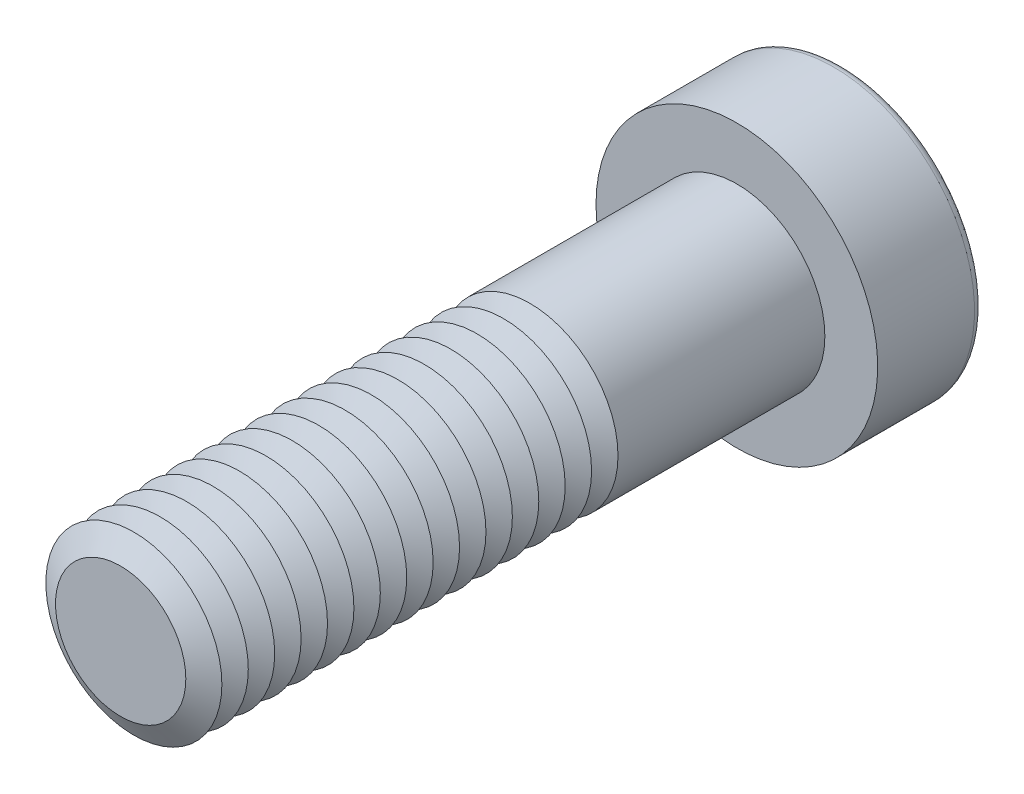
ISO-10303-21;
HEADER;
FILE_DESCRIPTION(('STEP AP214'),'2;1');
FILE_NAME('part.step','',(''),(''),'','','');
FILE_SCHEMA(('AUTOMOTIVE_DESIGN { 1 0 10303 214 1 1 1 1 }'));
ENDSEC;
DATA;
#1=APPLICATION_CONTEXT('core data for automotive mechanical design processes');
#2=APPLICATION_PROTOCOL_DEFINITION('international standard','automotive_design',2000,#1);
#3=PRODUCT_CONTEXT('',#1,'mechanical');
#4=PRODUCT('Part','Part','',(#3));
#5=PRODUCT_RELATED_PRODUCT_CATEGORY('part','',(#4));
#6=PRODUCT_DEFINITION_FORMATION('','',#4);
#7=PRODUCT_DEFINITION_CONTEXT('part definition',#1,'design');
#8=PRODUCT_DEFINITION('design','',#6,#7);
#9=PRODUCT_DEFINITION_SHAPE('','',#8);
#10=(LENGTH_UNIT() NAMED_UNIT(*) SI_UNIT(.MILLI.,.METRE.));
#11=(NAMED_UNIT(*) PLANE_ANGLE_UNIT() SI_UNIT($,.RADIAN.));
#12=(NAMED_UNIT(*) SI_UNIT($,.STERADIAN.) SOLID_ANGLE_UNIT());
#13=UNCERTAINTY_MEASURE_WITH_UNIT(LENGTH_MEASURE(1.E-05),#10,'distance_accuracy_value','');
#14=(GEOMETRIC_REPRESENTATION_CONTEXT(3) GLOBAL_UNCERTAINTY_ASSIGNED_CONTEXT((#13)) GLOBAL_UNIT_ASSIGNED_CONTEXT((#10,
#11,#12)) REPRESENTATION_CONTEXT('',''));
#15=CARTESIAN_POINT('',(0.,0.,0.));
#16=DIRECTION('',(0.,0.,1.));
#17=DIRECTION('',(1.,0.,0.));
#18=AXIS2_PLACEMENT_3D('',#15,#16,#17);
#19=CARTESIAN_POINT('',(0.,0.,29.75));
#20=DIRECTION('',(0.,0.,1.));
#21=DIRECTION('',(1.,0.,0.));
#22=AXIS2_PLACEMENT_3D('',#19,#20,#21);
#23=CONICAL_SURFACE('',#22,5.,1.0471975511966);
#24=CARTESIAN_POINT('',(0.,0.,29.));
#25=DIRECTION('',(0.,0.,1.));
#26=DIRECTION('',(1.,0.,0.));
#27=AXIS2_PLACEMENT_3D('',#24,#25,#26);
#28=CIRCLE('',#27,3.70096189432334);
#29=CARTESIAN_POINT('',(3.70096189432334,0.,29.));
#30=VERTEX_POINT('',#29);
#31=EDGE_CURVE('E313',#30,#30,#28,.T.);
#32=ORIENTED_EDGE('',*,*,#31,.T.);
#33=EDGE_LOOP('',(#32));
#34=FACE_BOUND('',#33,.T.);
#35=CARTESIAN_POINT('',(0.,0.,29.75));
#36=DIRECTION('',(0.,0.,1.));
#37=DIRECTION('',(1.,0.,0.));
#38=AXIS2_PLACEMENT_3D('',#35,#36,#37);
#39=CIRCLE('',#38,5.);
#40=CARTESIAN_POINT('',(5.,0.,29.75));
#41=VERTEX_POINT('',#40);
#42=EDGE_CURVE('E316',#41,#41,#39,.T.);
#43=ORIENTED_EDGE('',*,*,#42,.F.);
#44=EDGE_LOOP('',(#43));
#45=FACE_BOUND('',#44,.T.);
#46=ADVANCED_FACE('F39',(#34,#45),#23,.T.);
#47=CARTESIAN_POINT('',(0.,0.,29.));
#48=DIRECTION('',(0.,0.,-1.));
#49=DIRECTION('',(-1.,0.,0.));
#50=AXIS2_PLACEMENT_3D('',#47,#48,#49);
#51=CONICAL_SURFACE('',#50,3.70096189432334,1.0471975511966);
#52=CARTESIAN_POINT('',(0.,0.,28.25));
#53=DIRECTION('',(0.,0.,1.));
#54=DIRECTION('',(1.,0.,0.));
#55=AXIS2_PLACEMENT_3D('',#52,#53,#54);
#56=CIRCLE('',#55,5.);
#57=CARTESIAN_POINT('',(5.,0.,28.25));
#58=VERTEX_POINT('',#57);
#59=EDGE_CURVE('E324',#58,#58,#56,.T.);
#60=ORIENTED_EDGE('',*,*,#59,.T.);
#61=EDGE_LOOP('',(#60));
#62=FACE_BOUND('',#61,.T.);
#63=ORIENTED_EDGE('',*,*,#31,.F.);
#64=EDGE_LOOP('',(#63));
#65=FACE_BOUND('',#64,.T.);
#66=ADVANCED_FACE('F245',(#62,#65),#51,.T.);
#67=CARTESIAN_POINT('',(0.,0.,35.));
#68=DIRECTION('',(0.,0.,1.));
#69=DIRECTION('',(1.,0.,0.));
#70=AXIS2_PLACEMENT_3D('',#67,#68,#69);
#71=PLANE('',#70);
#72=CARTESIAN_POINT('',(0.,0.,35.));
#73=DIRECTION('',(0.,0.,1.));
#74=DIRECTION('',(1.,0.,0.));
#75=AXIS2_PLACEMENT_3D('',#72,#73,#74);
#76=CIRCLE('',#75,3.70096189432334);
#77=CARTESIAN_POINT('',(3.70096189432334,0.,35.));
#78=VERTEX_POINT('',#77);
#79=EDGE_CURVE('E174',#78,#78,#76,.T.);
#80=ORIENTED_EDGE('',*,*,#79,.T.);
#81=EDGE_LOOP('',(#80));
#82=FACE_BOUND('',#81,.T.);
#83=ADVANCED_FACE('F251',(#82),#71,.T.);
#84=CARTESIAN_POINT('',(0.,0.,35.));
#85=DIRECTION('',(0.,0.,-1.));
#86=DIRECTION('',(-1.,0.,0.));
#87=AXIS2_PLACEMENT_3D('',#84,#85,#86);
#88=CONICAL_SURFACE('',#87,3.70096189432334,1.0471975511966);
#89=CARTESIAN_POINT('',(0.,0.,34.25));
#90=DIRECTION('',(0.,0.,1.));
#91=DIRECTION('',(1.,0.,0.));
#92=AXIS2_PLACEMENT_3D('',#89,#90,#91);
#93=CIRCLE('',#92,5.);
#94=CARTESIAN_POINT('',(5.,0.,34.25));
#95=VERTEX_POINT('',#94);
#96=EDGE_CURVE('E291',#95,#95,#93,.T.);
#97=ORIENTED_EDGE('',*,*,#96,.T.);
#98=EDGE_LOOP('',(#97));
#99=FACE_BOUND('',#98,.T.);
#100=ORIENTED_EDGE('',*,*,#79,.F.);
#101=EDGE_LOOP('',(#100));
#102=FACE_BOUND('',#101,.T.);
#103=ADVANCED_FACE('F199',(#99,#102),#88,.T.);
#104=CARTESIAN_POINT('',(0.,0.,34.25));
#105=DIRECTION('',(0.,0.,1.));
#106=DIRECTION('',(1.,0.,0.));
#107=AXIS2_PLACEMENT_3D('',#104,#105,#106);
#108=CONICAL_SURFACE('',#107,5.,1.0471975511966);
#109=CARTESIAN_POINT('',(0.,0.,33.5));
#110=DIRECTION('',(0.,0.,1.));
#111=DIRECTION('',(1.,0.,0.));
#112=AXIS2_PLACEMENT_3D('',#109,#110,#111);
#113=CIRCLE('',#112,3.70096189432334);
#114=CARTESIAN_POINT('',(3.70096189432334,0.,33.5));
#115=VERTEX_POINT('',#114);
#116=EDGE_CURVE('E288',#115,#115,#113,.T.);
#117=ORIENTED_EDGE('',*,*,#116,.T.);
#118=EDGE_LOOP('',(#117));
#119=FACE_BOUND('',#118,.T.);
#120=ORIENTED_EDGE('',*,*,#96,.F.);
#121=EDGE_LOOP('',(#120));
#122=FACE_BOUND('',#121,.T.);
#123=ADVANCED_FACE('F277',(#119,#122),#108,.T.);
#124=CARTESIAN_POINT('',(0.,0.,33.5));
#125=DIRECTION('',(0.,0.,-1.));
#126=DIRECTION('',(-1.,0.,0.));
#127=AXIS2_PLACEMENT_3D('',#124,#125,#126);
#128=CONICAL_SURFACE('',#127,3.70096189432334,1.0471975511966);
#129=CARTESIAN_POINT('',(0.,0.,32.75));
#130=DIRECTION('',(0.,0.,1.));
#131=DIRECTION('',(1.,0.,0.));
#132=AXIS2_PLACEMENT_3D('',#129,#130,#131);
#133=CIRCLE('',#132,5.);
#134=CARTESIAN_POINT('',(5.,0.,32.75));
#135=VERTEX_POINT('',#134);
#136=EDGE_CURVE('E299',#135,#135,#133,.T.);
#137=ORIENTED_EDGE('',*,*,#136,.T.);
#138=EDGE_LOOP('',(#137));
#139=FACE_BOUND('',#138,.T.);
#140=ORIENTED_EDGE('',*,*,#116,.F.);
#141=EDGE_LOOP('',(#140));
#142=FACE_BOUND('',#141,.T.);
#143=ADVANCED_FACE('F274',(#139,#142),#128,.T.);
#144=CARTESIAN_POINT('',(0.,0.,32.75));
#145=DIRECTION('',(0.,0.,1.));
#146=DIRECTION('',(1.,0.,0.));
#147=AXIS2_PLACEMENT_3D('',#144,#145,#146);
#148=CONICAL_SURFACE('',#147,5.,1.0471975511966);
#149=CARTESIAN_POINT('',(0.,0.,32.));
#150=DIRECTION('',(0.,0.,1.));
#151=DIRECTION('',(1.,0.,0.));
#152=AXIS2_PLACEMENT_3D('',#149,#150,#151);
#153=CIRCLE('',#152,3.70096189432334);
#154=CARTESIAN_POINT('',(3.70096189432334,0.,32.));
#155=VERTEX_POINT('',#154);
#156=EDGE_CURVE('E293',#155,#155,#153,.T.);
#157=ORIENTED_EDGE('',*,*,#156,.T.);
#158=EDGE_LOOP('',(#157));
#159=FACE_BOUND('',#158,.T.);
#160=ORIENTED_EDGE('',*,*,#136,.F.);
#161=EDGE_LOOP('',(#160));
#162=FACE_BOUND('',#161,.T.);
#163=ADVANCED_FACE('F270',(#159,#162),#148,.T.);
#164=CARTESIAN_POINT('',(0.,0.,32.));
#165=DIRECTION('',(0.,0.,-1.));
#166=DIRECTION('',(-1.,0.,0.));
#167=AXIS2_PLACEMENT_3D('',#164,#165,#166);
#168=CONICAL_SURFACE('',#167,3.70096189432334,1.0471975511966);
#169=CARTESIAN_POINT('',(0.,0.,31.25));
#170=DIRECTION('',(0.,0.,1.));
#171=DIRECTION('',(1.,0.,0.));
#172=AXIS2_PLACEMENT_3D('',#169,#170,#171);
#173=CIRCLE('',#172,5.);
#174=CARTESIAN_POINT('',(5.,0.,31.25));
#175=VERTEX_POINT('',#174);
#176=EDGE_CURVE('E309',#175,#175,#173,.T.);
#177=ORIENTED_EDGE('',*,*,#176,.T.);
#178=EDGE_LOOP('',(#177));
#179=FACE_BOUND('',#178,.T.);
#180=ORIENTED_EDGE('',*,*,#156,.F.);
#181=EDGE_LOOP('',(#180));
#182=FACE_BOUND('',#181,.T.);
#183=ADVANCED_FACE('F266',(#179,#182),#168,.T.);
#184=CARTESIAN_POINT('',(0.,0.,31.25));
#185=DIRECTION('',(0.,0.,1.));
#186=DIRECTION('',(1.,0.,0.));
#187=AXIS2_PLACEMENT_3D('',#184,#185,#186);
#188=CONICAL_SURFACE('',#187,5.,1.0471975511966);
#189=CARTESIAN_POINT('',(0.,0.,30.5));
#190=DIRECTION('',(0.,0.,1.));
#191=DIRECTION('',(1.,0.,0.));
#192=AXIS2_PLACEMENT_3D('',#189,#190,#191);
#193=CIRCLE('',#192,3.70096189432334);
#194=CARTESIAN_POINT('',(3.70096189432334,0.,30.5));
#195=VERTEX_POINT('',#194);
#196=EDGE_CURVE('E305',#195,#195,#193,.T.);
#197=ORIENTED_EDGE('',*,*,#196,.T.);
#198=EDGE_LOOP('',(#197));
#199=FACE_BOUND('',#198,.T.);
#200=ORIENTED_EDGE('',*,*,#176,.F.);
#201=EDGE_LOOP('',(#200));
#202=FACE_BOUND('',#201,.T.);
#203=ADVANCED_FACE('F262',(#199,#202),#188,.T.);
#204=CARTESIAN_POINT('',(0.,0.,30.5));
#205=DIRECTION('',(0.,0.,-1.));
#206=DIRECTION('',(-1.,0.,0.));
#207=AXIS2_PLACEMENT_3D('',#204,#205,#206);
#208=CONICAL_SURFACE('',#207,3.70096189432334,1.0471975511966);
#209=ORIENTED_EDGE('',*,*,#42,.T.);
#210=EDGE_LOOP('',(#209));
#211=FACE_BOUND('',#210,.T.);
#212=ORIENTED_EDGE('',*,*,#196,.F.);
#213=EDGE_LOOP('',(#212));
#214=FACE_BOUND('',#213,.T.);
#215=ADVANCED_FACE('F258',(#211,#214),#208,.T.);
#216=CARTESIAN_POINT('',(0.,0.,28.25));
#217=DIRECTION('',(0.,0.,1.));
#218=DIRECTION('',(1.,0.,0.));
#219=AXIS2_PLACEMENT_3D('',#216,#217,#218);
#220=CONICAL_SURFACE('',#219,5.,1.0471975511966);
#221=CARTESIAN_POINT('',(0.,0.,27.5));
#222=DIRECTION('',(0.,0.,1.));
#223=DIRECTION('',(1.,0.,0.));
#224=AXIS2_PLACEMENT_3D('',#221,#222,#223);
#225=CIRCLE('',#224,3.70096189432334);
#226=CARTESIAN_POINT('',(3.70096189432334,0.,27.5));
#227=VERTEX_POINT('',#226);
#228=EDGE_CURVE('E320',#227,#227,#225,.T.);
#229=ORIENTED_EDGE('',*,*,#228,.T.);
#230=EDGE_LOOP('',(#229));
#231=FACE_BOUND('',#230,.T.);
#232=ORIENTED_EDGE('',*,*,#59,.F.);
#233=EDGE_LOOP('',(#232));
#234=FACE_BOUND('',#233,.T.);
#235=ADVANCED_FACE('F261',(#231,#234),#220,.T.);
#236=CARTESIAN_POINT('',(0.,0.,27.5));
#237=DIRECTION('',(0.,0.,-1.));
#238=DIRECTION('',(-1.,0.,0.));
#239=AXIS2_PLACEMENT_3D('',#236,#237,#238);
#240=CONICAL_SURFACE('',#239,3.70096189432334,1.0471975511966);
#241=CARTESIAN_POINT('',(0.,0.,26.75));
#242=DIRECTION('',(0.,0.,1.));
#243=DIRECTION('',(1.,0.,0.));
#244=AXIS2_PLACEMENT_3D('',#241,#242,#243);
#245=CIRCLE('',#244,5.);
#246=CARTESIAN_POINT('',(5.,0.,26.75));
#247=VERTEX_POINT('',#246);
#248=EDGE_CURVE('E332',#247,#247,#245,.T.);
#249=ORIENTED_EDGE('',*,*,#248,.T.);
#250=EDGE_LOOP('',(#249));
#251=FACE_BOUND('',#250,.T.);
#252=ORIENTED_EDGE('',*,*,#228,.F.);
#253=EDGE_LOOP('',(#252));
#254=FACE_BOUND('',#253,.T.);
#255=ADVANCED_FACE('F495',(#251,#254),#240,.T.);
#256=CARTESIAN_POINT('',(0.,0.,26.75));
#257=DIRECTION('',(0.,0.,1.));
#258=DIRECTION('',(1.,0.,0.));
#259=AXIS2_PLACEMENT_3D('',#256,#257,#258);
#260=CONICAL_SURFACE('',#259,5.,1.0471975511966);
#261=CARTESIAN_POINT('',(0.,0.,26.));
#262=DIRECTION('',(0.,0.,1.));
#263=DIRECTION('',(1.,0.,0.));
#264=AXIS2_PLACEMENT_3D('',#261,#262,#263);
#265=CIRCLE('',#264,3.70096189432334);
#266=CARTESIAN_POINT('',(3.70096189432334,0.,26.));
#267=VERTEX_POINT('',#266);
#268=EDGE_CURVE('E328',#267,#267,#265,.T.);
#269=ORIENTED_EDGE('',*,*,#268,.T.);
#270=EDGE_LOOP('',(#269));
#271=FACE_BOUND('',#270,.T.);
#272=ORIENTED_EDGE('',*,*,#248,.F.);
#273=EDGE_LOOP('',(#272));
#274=FACE_BOUND('',#273,.T.);
#275=ADVANCED_FACE('F491',(#271,#274),#260,.T.);
#276=CARTESIAN_POINT('',(0.,0.,26.));
#277=DIRECTION('',(0.,0.,-1.));
#278=DIRECTION('',(-1.,0.,0.));
#279=AXIS2_PLACEMENT_3D('',#276,#277,#278);
#280=CONICAL_SURFACE('',#279,3.70096189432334,1.0471975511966);
#281=CARTESIAN_POINT('',(0.,0.,25.25));
#282=DIRECTION('',(0.,0.,1.));
#283=DIRECTION('',(1.,0.,0.));
#284=AXIS2_PLACEMENT_3D('',#281,#282,#283);
#285=CIRCLE('',#284,5.);
#286=CARTESIAN_POINT('',(5.,0.,25.25));
#287=VERTEX_POINT('',#286);
#288=EDGE_CURVE('E340',#287,#287,#285,.T.);
#289=ORIENTED_EDGE('',*,*,#288,.T.);
#290=EDGE_LOOP('',(#289));
#291=FACE_BOUND('',#290,.T.);
#292=ORIENTED_EDGE('',*,*,#268,.F.);
#293=EDGE_LOOP('',(#292));
#294=FACE_BOUND('',#293,.T.);
#295=ADVANCED_FACE('F487',(#291,#294),#280,.T.);
#296=CARTESIAN_POINT('',(0.,0.,25.25));
#297=DIRECTION('',(0.,0.,1.));
#298=DIRECTION('',(1.,0.,0.));
#299=AXIS2_PLACEMENT_3D('',#296,#297,#298);
#300=CONICAL_SURFACE('',#299,5.,1.0471975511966);
#301=CARTESIAN_POINT('',(0.,0.,24.5));
#302=DIRECTION('',(0.,0.,1.));
#303=DIRECTION('',(1.,0.,0.));
#304=AXIS2_PLACEMENT_3D('',#301,#302,#303);
#305=CIRCLE('',#304,3.70096189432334);
#306=CARTESIAN_POINT('',(3.70096189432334,0.,24.5));
#307=VERTEX_POINT('',#306);
#308=EDGE_CURVE('E336',#307,#307,#305,.T.);
#309=ORIENTED_EDGE('',*,*,#308,.T.);
#310=EDGE_LOOP('',(#309));
#311=FACE_BOUND('',#310,.T.);
#312=ORIENTED_EDGE('',*,*,#288,.F.);
#313=EDGE_LOOP('',(#312));
#314=FACE_BOUND('',#313,.T.);
#315=ADVANCED_FACE('F483',(#311,#314),#300,.T.);
#316=CARTESIAN_POINT('',(0.,0.,24.5));
#317=DIRECTION('',(0.,0.,-1.));
#318=DIRECTION('',(-1.,0.,0.));
#319=AXIS2_PLACEMENT_3D('',#316,#317,#318);
#320=CONICAL_SURFACE('',#319,3.70096189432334,1.0471975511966);
#321=CARTESIAN_POINT('',(0.,0.,23.75));
#322=DIRECTION('',(0.,0.,1.));
#323=DIRECTION('',(1.,0.,0.));
#324=AXIS2_PLACEMENT_3D('',#321,#322,#323);
#325=CIRCLE('',#324,5.);
#326=CARTESIAN_POINT('',(5.,0.,23.75));
#327=VERTEX_POINT('',#326);
#328=EDGE_CURVE('E348',#327,#327,#325,.T.);
#329=ORIENTED_EDGE('',*,*,#328,.T.);
#330=EDGE_LOOP('',(#329));
#331=FACE_BOUND('',#330,.T.);
#332=ORIENTED_EDGE('',*,*,#308,.F.);
#333=EDGE_LOOP('',(#332));
#334=FACE_BOUND('',#333,.T.);
#335=ADVANCED_FACE('F479',(#331,#334),#320,.T.);
#336=CARTESIAN_POINT('',(0.,0.,23.75));
#337=DIRECTION('',(0.,0.,1.));
#338=DIRECTION('',(1.,0.,0.));
#339=AXIS2_PLACEMENT_3D('',#336,#337,#338);
#340=CONICAL_SURFACE('',#339,5.,1.0471975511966);
#341=CARTESIAN_POINT('',(0.,0.,23.));
#342=DIRECTION('',(0.,0.,1.));
#343=DIRECTION('',(1.,0.,0.));
#344=AXIS2_PLACEMENT_3D('',#341,#342,#343);
#345=CIRCLE('',#344,3.70096189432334);
#346=CARTESIAN_POINT('',(3.70096189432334,0.,23.));
#347=VERTEX_POINT('',#346);
#348=EDGE_CURVE('E344',#347,#347,#345,.T.);
#349=ORIENTED_EDGE('',*,*,#348,.T.);
#350=EDGE_LOOP('',(#349));
#351=FACE_BOUND('',#350,.T.);
#352=ORIENTED_EDGE('',*,*,#328,.F.);
#353=EDGE_LOOP('',(#352));
#354=FACE_BOUND('',#353,.T.);
#355=ADVANCED_FACE('F475',(#351,#354),#340,.T.);
#356=CARTESIAN_POINT('',(0.,0.,23.));
#357=DIRECTION('',(0.,0.,-1.));
#358=DIRECTION('',(-1.,0.,0.));
#359=AXIS2_PLACEMENT_3D('',#356,#357,#358);
#360=CONICAL_SURFACE('',#359,3.70096189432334,1.0471975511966);
#361=CARTESIAN_POINT('',(0.,0.,22.25));
#362=DIRECTION('',(0.,0.,1.));
#363=DIRECTION('',(1.,0.,0.));
#364=AXIS2_PLACEMENT_3D('',#361,#362,#363);
#365=CIRCLE('',#364,5.);
#366=CARTESIAN_POINT('',(5.,0.,22.25));
#367=VERTEX_POINT('',#366);
#368=EDGE_CURVE('E356',#367,#367,#365,.T.);
#369=ORIENTED_EDGE('',*,*,#368,.T.);
#370=EDGE_LOOP('',(#369));
#371=FACE_BOUND('',#370,.T.);
#372=ORIENTED_EDGE('',*,*,#348,.F.);
#373=EDGE_LOOP('',(#372));
#374=FACE_BOUND('',#373,.T.);
#375=ADVANCED_FACE('F471',(#371,#374),#360,.T.);
#376=CARTESIAN_POINT('',(0.,0.,22.25));
#377=DIRECTION('',(0.,0.,1.));
#378=DIRECTION('',(1.,0.,0.));
#379=AXIS2_PLACEMENT_3D('',#376,#377,#378);
#380=CONICAL_SURFACE('',#379,5.,1.0471975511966);
#381=CARTESIAN_POINT('',(0.,0.,21.5));
#382=DIRECTION('',(0.,0.,1.));
#383=DIRECTION('',(1.,0.,0.));
#384=AXIS2_PLACEMENT_3D('',#381,#382,#383);
#385=CIRCLE('',#384,3.70096189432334);
#386=CARTESIAN_POINT('',(3.70096189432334,0.,21.5));
#387=VERTEX_POINT('',#386);
#388=EDGE_CURVE('E352',#387,#387,#385,.T.);
#389=ORIENTED_EDGE('',*,*,#388,.T.);
#390=EDGE_LOOP('',(#389));
#391=FACE_BOUND('',#390,.T.);
#392=ORIENTED_EDGE('',*,*,#368,.F.);
#393=EDGE_LOOP('',(#392));
#394=FACE_BOUND('',#393,.T.);
#395=ADVANCED_FACE('F467',(#391,#394),#380,.T.);
#396=CARTESIAN_POINT('',(0.,0.,21.5));
#397=DIRECTION('',(0.,0.,-1.));
#398=DIRECTION('',(-1.,0.,0.));
#399=AXIS2_PLACEMENT_3D('',#396,#397,#398);
#400=CONICAL_SURFACE('',#399,3.70096189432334,1.0471975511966);
#401=CARTESIAN_POINT('',(0.,0.,20.75));
#402=DIRECTION('',(0.,0.,1.));
#403=DIRECTION('',(1.,0.,0.));
#404=AXIS2_PLACEMENT_3D('',#401,#402,#403);
#405=CIRCLE('',#404,5.);
#406=CARTESIAN_POINT('',(5.,0.,20.75));
#407=VERTEX_POINT('',#406);
#408=EDGE_CURVE('E364',#407,#407,#405,.T.);
#409=ORIENTED_EDGE('',*,*,#408,.T.);
#410=EDGE_LOOP('',(#409));
#411=FACE_BOUND('',#410,.T.);
#412=ORIENTED_EDGE('',*,*,#388,.F.);
#413=EDGE_LOOP('',(#412));
#414=FACE_BOUND('',#413,.T.);
#415=ADVANCED_FACE('F463',(#411,#414),#400,.T.);
#416=CARTESIAN_POINT('',(0.,0.,20.75));
#417=DIRECTION('',(0.,0.,1.));
#418=DIRECTION('',(1.,0.,0.));
#419=AXIS2_PLACEMENT_3D('',#416,#417,#418);
#420=CONICAL_SURFACE('',#419,5.,1.0471975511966);
#421=CARTESIAN_POINT('',(0.,0.,20.));
#422=DIRECTION('',(0.,0.,1.));
#423=DIRECTION('',(1.,0.,0.));
#424=AXIS2_PLACEMENT_3D('',#421,#422,#423);
#425=CIRCLE('',#424,3.70096189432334);
#426=CARTESIAN_POINT('',(3.70096189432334,0.,20.));
#427=VERTEX_POINT('',#426);
#428=EDGE_CURVE('E360',#427,#427,#425,.T.);
#429=ORIENTED_EDGE('',*,*,#428,.T.);
#430=EDGE_LOOP('',(#429));
#431=FACE_BOUND('',#430,.T.);
#432=ORIENTED_EDGE('',*,*,#408,.F.);
#433=EDGE_LOOP('',(#432));
#434=FACE_BOUND('',#433,.T.);
#435=ADVANCED_FACE('F459',(#431,#434),#420,.T.);
#436=CARTESIAN_POINT('',(0.,0.,20.));
#437=DIRECTION('',(0.,0.,-1.));
#438=DIRECTION('',(-1.,0.,0.));
#439=AXIS2_PLACEMENT_3D('',#436,#437,#438);
#440=CONICAL_SURFACE('',#439,3.70096189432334,1.0471975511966);
#441=CARTESIAN_POINT('',(0.,0.,19.25));
#442=DIRECTION('',(0.,0.,1.));
#443=DIRECTION('',(1.,0.,0.));
#444=AXIS2_PLACEMENT_3D('',#441,#442,#443);
#445=CIRCLE('',#444,5.);
#446=CARTESIAN_POINT('',(5.,0.,19.25));
#447=VERTEX_POINT('',#446);
#448=EDGE_CURVE('E371',#447,#447,#445,.T.);
#449=ORIENTED_EDGE('',*,*,#448,.T.);
#450=EDGE_LOOP('',(#449));
#451=FACE_BOUND('',#450,.T.);
#452=ORIENTED_EDGE('',*,*,#428,.F.);
#453=EDGE_LOOP('',(#452));
#454=FACE_BOUND('',#453,.T.);
#455=ADVANCED_FACE('F455',(#451,#454),#440,.T.);
#456=CARTESIAN_POINT('',(0.,0.,19.25));
#457=DIRECTION('',(0.,0.,1.));
#458=DIRECTION('',(1.,0.,0.));
#459=AXIS2_PLACEMENT_3D('',#456,#457,#458);
#460=CONICAL_SURFACE('',#459,5.,1.0471975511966);
#461=CARTESIAN_POINT('',(0.,0.,18.5));
#462=DIRECTION('',(0.,0.,1.));
#463=DIRECTION('',(1.,0.,0.));
#464=AXIS2_PLACEMENT_3D('',#461,#462,#463);
#465=CIRCLE('',#464,3.70096189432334);
#466=CARTESIAN_POINT('',(3.70096189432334,0.,18.5));
#467=VERTEX_POINT('',#466);
#468=EDGE_CURVE('E368',#467,#467,#465,.T.);
#469=ORIENTED_EDGE('',*,*,#468,.T.);
#470=EDGE_LOOP('',(#469));
#471=FACE_BOUND('',#470,.T.);
#472=ORIENTED_EDGE('',*,*,#448,.F.);
#473=EDGE_LOOP('',(#472));
#474=FACE_BOUND('',#473,.T.);
#475=ADVANCED_FACE('F451',(#471,#474),#460,.T.);
#476=CARTESIAN_POINT('',(0.,0.,18.5));
#477=DIRECTION('',(0.,0.,-1.));
#478=DIRECTION('',(-1.,0.,0.));
#479=AXIS2_PLACEMENT_3D('',#476,#477,#478);
#480=CONICAL_SURFACE('',#479,3.70096189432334,1.0471975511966);
#481=CARTESIAN_POINT('',(0.,0.,17.75));
#482=DIRECTION('',(0.,0.,1.));
#483=DIRECTION('',(1.,0.,0.));
#484=AXIS2_PLACEMENT_3D('',#481,#482,#483);
#485=CIRCLE('',#484,5.);
#486=CARTESIAN_POINT('',(5.,0.,17.75));
#487=VERTEX_POINT('',#486);
#488=EDGE_CURVE('E379',#487,#487,#485,.T.);
#489=ORIENTED_EDGE('',*,*,#488,.T.);
#490=EDGE_LOOP('',(#489));
#491=FACE_BOUND('',#490,.T.);
#492=ORIENTED_EDGE('',*,*,#468,.F.);
#493=EDGE_LOOP('',(#492));
#494=FACE_BOUND('',#493,.T.);
#495=ADVANCED_FACE('F447',(#491,#494),#480,.T.);
#496=CARTESIAN_POINT('',(0.,0.,17.75));
#497=DIRECTION('',(0.,0.,1.));
#498=DIRECTION('',(1.,0.,0.));
#499=AXIS2_PLACEMENT_3D('',#496,#497,#498);
#500=CONICAL_SURFACE('',#499,5.,1.0471975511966);
#501=CARTESIAN_POINT('',(0.,0.,17.));
#502=DIRECTION('',(0.,0.,1.));
#503=DIRECTION('',(1.,0.,0.));
#504=AXIS2_PLACEMENT_3D('',#501,#502,#503);
#505=CIRCLE('',#504,3.70096189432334);
#506=CARTESIAN_POINT('',(3.70096189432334,0.,17.));
#507=VERTEX_POINT('',#506);
#508=EDGE_CURVE('E375',#507,#507,#505,.T.);
#509=ORIENTED_EDGE('',*,*,#508,.T.);
#510=EDGE_LOOP('',(#509));
#511=FACE_BOUND('',#510,.T.);
#512=ORIENTED_EDGE('',*,*,#488,.F.);
#513=EDGE_LOOP('',(#512));
#514=FACE_BOUND('',#513,.T.);
#515=ADVANCED_FACE('F443',(#511,#514),#500,.T.);
#516=CARTESIAN_POINT('',(0.,0.,17.));
#517=DIRECTION('',(0.,0.,-1.));
#518=DIRECTION('',(-1.,0.,0.));
#519=AXIS2_PLACEMENT_3D('',#516,#517,#518);
#520=CONICAL_SURFACE('',#519,3.70096189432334,1.0471975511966);
#521=CARTESIAN_POINT('',(0.,0.,16.25));
#522=DIRECTION('',(0.,0.,1.));
#523=DIRECTION('',(1.,0.,0.));
#524=AXIS2_PLACEMENT_3D('',#521,#522,#523);
#525=CIRCLE('',#524,5.);
#526=CARTESIAN_POINT('',(5.,0.,16.25));
#527=VERTEX_POINT('',#526);
#528=EDGE_CURVE('E387',#527,#527,#525,.T.);
#529=ORIENTED_EDGE('',*,*,#528,.T.);
#530=EDGE_LOOP('',(#529));
#531=FACE_BOUND('',#530,.T.);
#532=ORIENTED_EDGE('',*,*,#508,.F.);
#533=EDGE_LOOP('',(#532));
#534=FACE_BOUND('',#533,.T.);
#535=ADVANCED_FACE('F439',(#531,#534),#520,.T.);
#536=CARTESIAN_POINT('',(0.,0.,16.25));
#537=DIRECTION('',(0.,0.,1.));
#538=DIRECTION('',(1.,0.,0.));
#539=AXIS2_PLACEMENT_3D('',#536,#537,#538);
#540=CONICAL_SURFACE('',#539,5.,1.0471975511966);
#541=CARTESIAN_POINT('',(0.,0.,15.5));
#542=DIRECTION('',(0.,0.,1.));
#543=DIRECTION('',(1.,0.,0.));
#544=AXIS2_PLACEMENT_3D('',#541,#542,#543);
#545=CIRCLE('',#544,3.70096189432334);
#546=CARTESIAN_POINT('',(3.70096189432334,0.,15.5));
#547=VERTEX_POINT('',#546);
#548=EDGE_CURVE('E383',#547,#547,#545,.T.);
#549=ORIENTED_EDGE('',*,*,#548,.T.);
#550=EDGE_LOOP('',(#549));
#551=FACE_BOUND('',#550,.T.);
#552=ORIENTED_EDGE('',*,*,#528,.F.);
#553=EDGE_LOOP('',(#552));
#554=FACE_BOUND('',#553,.T.);
#555=ADVANCED_FACE('F435',(#551,#554),#540,.T.);
#556=CARTESIAN_POINT('',(0.,0.,15.5));
#557=DIRECTION('',(0.,0.,-1.));
#558=DIRECTION('',(-1.,0.,0.));
#559=AXIS2_PLACEMENT_3D('',#556,#557,#558);
#560=CONICAL_SURFACE('',#559,3.70096189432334,1.0471975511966);
#561=CARTESIAN_POINT('',(0.,0.,14.75));
#562=DIRECTION('',(0.,0.,1.));
#563=DIRECTION('',(1.,0.,0.));
#564=AXIS2_PLACEMENT_3D('',#561,#562,#563);
#565=CIRCLE('',#564,5.);
#566=CARTESIAN_POINT('',(5.,0.,14.75));
#567=VERTEX_POINT('',#566);
#568=EDGE_CURVE('E395',#567,#567,#565,.T.);
#569=ORIENTED_EDGE('',*,*,#568,.T.);
#570=EDGE_LOOP('',(#569));
#571=FACE_BOUND('',#570,.T.);
#572=ORIENTED_EDGE('',*,*,#548,.F.);
#573=EDGE_LOOP('',(#572));
#574=FACE_BOUND('',#573,.T.);
#575=ADVANCED_FACE('F431',(#571,#574),#560,.T.);
#576=CARTESIAN_POINT('',(0.,0.,14.75));
#577=DIRECTION('',(0.,0.,1.));
#578=DIRECTION('',(1.,0.,0.));
#579=AXIS2_PLACEMENT_3D('',#576,#577,#578);
#580=CONICAL_SURFACE('',#579,5.,1.0471975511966);
#581=CARTESIAN_POINT('',(0.,0.,14.));
#582=DIRECTION('',(0.,0.,1.));
#583=DIRECTION('',(1.,0.,0.));
#584=AXIS2_PLACEMENT_3D('',#581,#582,#583);
#585=CIRCLE('',#584,3.70096189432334);
#586=CARTESIAN_POINT('',(3.70096189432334,0.,14.));
#587=VERTEX_POINT('',#586);
#588=EDGE_CURVE('E391',#587,#587,#585,.T.);
#589=ORIENTED_EDGE('',*,*,#588,.T.);
#590=EDGE_LOOP('',(#589));
#591=FACE_BOUND('',#590,.T.);
#592=ORIENTED_EDGE('',*,*,#568,.F.);
#593=EDGE_LOOP('',(#592));
#594=FACE_BOUND('',#593,.T.);
#595=ADVANCED_FACE('F426',(#591,#594),#580,.T.);
#596=CARTESIAN_POINT('',(0.,0.,14.));
#597=DIRECTION('',(0.,0.,-1.));
#598=DIRECTION('',(-1.,0.,0.));
#599=AXIS2_PLACEMENT_3D('',#596,#597,#598);
#600=CONICAL_SURFACE('',#599,3.70096189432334,1.0471975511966);
#601=CARTESIAN_POINT('',(0.,0.,13.25));
#602=DIRECTION('',(0.,0.,1.));
#603=DIRECTION('',(1.,0.,0.));
#604=AXIS2_PLACEMENT_3D('',#601,#602,#603);
#605=CIRCLE('',#604,5.);
#606=CARTESIAN_POINT('',(5.,0.,13.25));
#607=VERTEX_POINT('',#606);
#608=EDGE_CURVE('E407',#607,#607,#605,.T.);
#609=ORIENTED_EDGE('',*,*,#608,.T.);
#610=EDGE_LOOP('',(#609));
#611=FACE_BOUND('',#610,.T.);
#612=ORIENTED_EDGE('',*,*,#588,.F.);
#613=EDGE_LOOP('',(#612));
#614=FACE_BOUND('',#613,.T.);
#615=ADVANCED_FACE('F412',(#611,#614),#600,.T.);
#616=CARTESIAN_POINT('',(0.,0.,13.25));
#617=DIRECTION('',(0.,0.,1.));
#618=DIRECTION('',(1.,0.,0.));
#619=AXIS2_PLACEMENT_3D('',#616,#617,#618);
#620=CONICAL_SURFACE('',#619,5.,1.0471975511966);
#621=CARTESIAN_POINT('',(0.,0.,12.5));
#622=DIRECTION('',(0.,0.,1.));
#623=DIRECTION('',(1.,0.,0.));
#624=AXIS2_PLACEMENT_3D('',#621,#622,#623);
#625=CIRCLE('',#624,3.70096189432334);
#626=CARTESIAN_POINT('',(3.70096189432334,0.,12.5));
#627=VERTEX_POINT('',#626);
#628=EDGE_CURVE('E399',#627,#627,#625,.T.);
#629=ORIENTED_EDGE('',*,*,#628,.T.);
#630=EDGE_LOOP('',(#629));
#631=FACE_BOUND('',#630,.T.);
#632=ORIENTED_EDGE('',*,*,#608,.F.);
#633=EDGE_LOOP('',(#632));
#634=FACE_BOUND('',#633,.T.);
#635=ADVANCED_FACE('F415',(#631,#634),#620,.T.);
#636=CARTESIAN_POINT('',(0.,0.,12.5));
#637=DIRECTION('',(0.,0.,-1.));
#638=DIRECTION('',(-1.,0.,0.));
#639=AXIS2_PLACEMENT_3D('',#636,#637,#638);
#640=CONICAL_SURFACE('',#639,3.70096189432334,1.0471975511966);
#641=CARTESIAN_POINT('',(0.,0.,11.75));
#642=DIRECTION('',(0.,0.,1.));
#643=DIRECTION('',(1.,0.,0.));
#644=AXIS2_PLACEMENT_3D('',#641,#642,#643);
#645=CIRCLE('',#644,5.);
#646=CARTESIAN_POINT('',(5.,0.,11.75));
#647=VERTEX_POINT('',#646);
#648=EDGE_CURVE('E403',#647,#647,#645,.T.);
#649=ORIENTED_EDGE('',*,*,#648,.T.);
#650=EDGE_LOOP('',(#649));
#651=FACE_BOUND('',#650,.T.);
#652=ORIENTED_EDGE('',*,*,#628,.F.);
#653=EDGE_LOOP('',(#652));
#654=FACE_BOUND('',#653,.T.);
#655=ADVANCED_FACE('F417',(#651,#654),#640,.T.);
#656=CARTESIAN_POINT('',(0.,0.,-0.75));
#657=DIRECTION('',(0.,0.,-1.));
#658=DIRECTION('',(-1.,0.,0.));
#659=AXIS2_PLACEMENT_3D('',#656,#657,#658);
#660=CONICAL_SURFACE('',#659,3.5,1.0471975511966);
#661=CARTESIAN_POINT('',(0.,0.,1.27072594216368));
#662=VERTEX_POINT('',#661);
#663=VERTEX_LOOP('',#662);
#664=FACE_BOUND('',#663,.T.);
#665=CARTESIAN_POINT('',(0.,0.,-0.75));
#666=DIRECTION('',(0.,0.,-1.));
#667=DIRECTION('',(-1.,0.,0.));
#668=AXIS2_PLACEMENT_3D('',#665,#666,#667);
#669=CIRCLE('',#668,3.5);
#670=CARTESIAN_POINT('',(-3.03108891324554,1.75,-0.75));
#671=VERTEX_POINT('',#670);
#672=CARTESIAN_POINT('',(0.,3.5,-0.75));
#673=VERTEX_POINT('',#672);
#674=EDGE_CURVE('E149',#671,#673,#669,.T.);
#675=ORIENTED_EDGE('',*,*,#674,.T.);
#676=CARTESIAN_POINT('',(0.,0.,-0.75));
#677=DIRECTION('',(0.,0.,-1.));
#678=DIRECTION('',(-1.,0.,0.));
#679=AXIS2_PLACEMENT_3D('',#676,#677,#678);
#680=CIRCLE('',#679,3.5);
#681=CARTESIAN_POINT('',(3.03108891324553,1.75,-0.75));
#682=VERTEX_POINT('',#681);
#683=EDGE_CURVE('E54',#673,#682,#680,.T.);
#684=ORIENTED_EDGE('',*,*,#683,.T.);
#685=CARTESIAN_POINT('',(3.03108891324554,-1.75,-0.75));
#686=VERTEX_POINT('',#685);
#687=EDGE_CURVE('E997',#682,#686,#680,.T.);
#688=ORIENTED_EDGE('',*,*,#687,.T.);
#689=CARTESIAN_POINT('',(0.,-3.5,-0.75));
#690=VERTEX_POINT('',#689);
#691=EDGE_CURVE('E996',#686,#690,#680,.T.);
#692=ORIENTED_EDGE('',*,*,#691,.T.);
#693=CARTESIAN_POINT('',(-3.03108891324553,-1.75,-0.75));
#694=VERTEX_POINT('',#693);
#695=EDGE_CURVE('E991',#690,#694,#680,.T.);
#696=ORIENTED_EDGE('',*,*,#695,.T.);
#697=EDGE_CURVE('E989',#694,#671,#680,.T.);
#698=ORIENTED_EDGE('',*,*,#697,.T.);
#699=EDGE_LOOP('',(#675,#684,#688,#692,#696,#698));
#700=FACE_BOUND('',#699,.T.);
#701=ADVANCED_FACE('F201',(#664,#700),#660,.F.);
#702=CARTESIAN_POINT('',(0.,0.,-0.75));
#703=DIRECTION('',(0.,0.,-1.));
#704=DIRECTION('',(-1.,0.,0.));
#705=AXIS2_PLACEMENT_3D('',#702,#703,#704);
#706=PLANE('',#705);
#707=ORIENTED_EDGE('',*,*,#683,.F.);
#708=DIRECTION('',(1.,0.,0.));
#709=VECTOR('',#708,1.);
#710=CARTESIAN_POINT('',(-2.02072594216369,3.5,-0.75));
#711=LINE('',#710,#709);
#712=CARTESIAN_POINT('',(2.02072594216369,3.5,-0.75));
#713=VERTEX_POINT('',#712);
#714=EDGE_CURVE('E1040',#673,#713,#711,.T.);
#715=ORIENTED_EDGE('',*,*,#714,.T.);
#716=DIRECTION('',(0.5,-0.866025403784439,0.));
#717=VECTOR('',#716,1.);
#718=CARTESIAN_POINT('',(2.02072594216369,3.5,-0.75));
#719=LINE('',#718,#717);
#720=EDGE_CURVE('E155',#713,#682,#719,.T.);
#721=ORIENTED_EDGE('',*,*,#720,.T.);
#722=EDGE_LOOP('',(#707,#715,#721));
#723=FACE_BOUND('',#722,.T.);
#724=ADVANCED_FACE('F584',(#723),#706,.T.);
#725=ORIENTED_EDGE('',*,*,#687,.F.);
#726=CARTESIAN_POINT('',(4.04145188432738,0.,-0.75));
#727=VERTEX_POINT('',#726);
#728=EDGE_CURVE('E1036',#682,#727,#719,.T.);
#729=ORIENTED_EDGE('',*,*,#728,.T.);
#730=DIRECTION('',(-0.5,-0.866025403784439,0.));
#731=VECTOR('',#730,1.);
#732=CARTESIAN_POINT('',(4.04145188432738,0.,-0.75));
#733=LINE('',#732,#731);
#734=EDGE_CURVE('E1010',#727,#686,#733,.T.);
#735=ORIENTED_EDGE('',*,*,#734,.T.);
#736=EDGE_LOOP('',(#725,#729,#735));
#737=FACE_BOUND('',#736,.T.);
#738=ADVANCED_FACE('F594',(#737),#706,.T.);
#739=ORIENTED_EDGE('',*,*,#691,.F.);
#740=CARTESIAN_POINT('',(2.02072594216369,-3.5,-0.75));
#741=VERTEX_POINT('',#740);
#742=EDGE_CURVE('E1012',#686,#741,#733,.T.);
#743=ORIENTED_EDGE('',*,*,#742,.T.);
#744=DIRECTION('',(-1.,0.,0.));
#745=VECTOR('',#744,1.);
#746=CARTESIAN_POINT('',(2.02072594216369,-3.5,-0.75));
#747=LINE('',#746,#745);
#748=EDGE_CURVE('E963',#741,#690,#747,.T.);
#749=ORIENTED_EDGE('',*,*,#748,.T.);
#750=EDGE_LOOP('',(#739,#743,#749));
#751=FACE_BOUND('',#750,.T.);
#752=ADVANCED_FACE('F604',(#751),#706,.T.);
#753=ORIENTED_EDGE('',*,*,#695,.F.);
#754=CARTESIAN_POINT('',(-2.02072594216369,-3.5,-0.75));
#755=VERTEX_POINT('',#754);
#756=EDGE_CURVE('E1006',#690,#755,#747,.T.);
#757=ORIENTED_EDGE('',*,*,#756,.T.);
#758=DIRECTION('',(-0.5,0.866025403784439,0.));
#759=VECTOR('',#758,1.);
#760=CARTESIAN_POINT('',(-2.02072594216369,-3.5,-0.75));
#761=LINE('',#760,#759);
#762=EDGE_CURVE('E1008',#755,#694,#761,.T.);
#763=ORIENTED_EDGE('',*,*,#762,.T.);
#764=EDGE_LOOP('',(#753,#757,#763));
#765=FACE_BOUND('',#764,.T.);
#766=ADVANCED_FACE('F612',(#765),#706,.T.);
#767=ORIENTED_EDGE('',*,*,#697,.F.);
#768=CARTESIAN_POINT('',(-4.04145188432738,0.,-0.75));
#769=VERTEX_POINT('',#768);
#770=EDGE_CURVE('E1014',#694,#769,#761,.T.);
#771=ORIENTED_EDGE('',*,*,#770,.T.);
#772=DIRECTION('',(0.5,0.866025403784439,0.));
#773=VECTOR('',#772,1.);
#774=CARTESIAN_POINT('',(-4.04145188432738,0.,-0.75));
#775=LINE('',#774,#773);
#776=EDGE_CURVE('E158',#769,#671,#775,.T.);
#777=ORIENTED_EDGE('',*,*,#776,.T.);
#778=EDGE_LOOP('',(#767,#771,#777));
#779=FACE_BOUND('',#778,.T.);
#780=ADVANCED_FACE('F231',(#779),#706,.T.);
#781=ORIENTED_EDGE('',*,*,#674,.F.);
#782=CARTESIAN_POINT('',(-2.02072594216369,3.5,-0.75));
#783=VERTEX_POINT('',#782);
#784=EDGE_CURVE('E1020',#671,#783,#775,.T.);
#785=ORIENTED_EDGE('',*,*,#784,.T.);
#786=EDGE_CURVE('E1038',#783,#673,#711,.T.);
#787=ORIENTED_EDGE('',*,*,#786,.T.);
#788=EDGE_LOOP('',(#781,#785,#787));
#789=FACE_BOUND('',#788,.T.);
#790=ADVANCED_FACE('F596',(#789),#706,.T.);
#791=CARTESIAN_POINT('',(-2.02072594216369,3.5,-0.75));
#792=DIRECTION('',(0.,1.,0.));
#793=DIRECTION('',(-1.,0.,0.));
#794=AXIS2_PLACEMENT_3D('',#791,#792,#793);
#795=PLANE('',#794);
#796=DIRECTION('',(0.,0.,-1.));
#797=VECTOR('',#796,1.);
#798=CARTESIAN_POINT('',(-2.02072594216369,3.5,-0.75));
#799=LINE('',#798,#797);
#800=CARTESIAN_POINT('',(-2.02072594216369,3.5,-6.));
#801=VERTEX_POINT('',#800);
#802=EDGE_CURVE('E147',#783,#801,#799,.T.);
#803=ORIENTED_EDGE('',*,*,#802,.T.);
#804=CARTESIAN_POINT('',(-5.27521327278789,3.5,-6.613404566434));
#805=CARTESIAN_POINT('',(-5.11717138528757,3.5,-6.57812703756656));
#806=CARTESIAN_POINT('',(-4.95902873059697,3.5,-6.5432936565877));
#807=CARTESIAN_POINT('',(-4.64249233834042,3.5,-6.47475322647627));
#808=CARTESIAN_POINT('',(-4.48409858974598,3.5,-6.44104622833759));
#809=CARTESIAN_POINT('',(-4.16686075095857,3.5,-6.37496567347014));
#810=CARTESIAN_POINT('',(-4.00801636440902,3.5,-6.34259353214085));
#811=CARTESIAN_POINT('',(-3.68999232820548,3.5,-6.27954992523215));
#812=CARTESIAN_POINT('',(-3.53081268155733,3.5,-6.24887844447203));
#813=CARTESIAN_POINT('',(-3.05545711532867,3.5,-6.16049717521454));
#814=CARTESIAN_POINT('',(-2.73870333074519,3.5,-6.10583257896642));
#815=CARTESIAN_POINT('',(-2.10326379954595,3.5,-6.00899390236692));
#816=CARTESIAN_POINT('',(-1.78457845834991,3.5,-5.9668172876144));
#817=CARTESIAN_POINT('',(-1.30331397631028,3.5,-5.91703310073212));
#818=CARTESIAN_POINT('',(-1.14143900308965,3.5,-5.90264327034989));
#819=CARTESIAN_POINT('',(-0.817296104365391,3.5,-5.87924021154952));
#820=CARTESIAN_POINT('',(-0.655028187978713,3.5,-5.87022685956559));
#821=CARTESIAN_POINT('',(-0.330337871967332,3.5,-5.8581019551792));
#822=CARTESIAN_POINT('',(-0.167915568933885,3.5,-5.85498786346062));
#823=CARTESIAN_POINT('',(0.156931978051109,3.5,-5.85485125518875));
#824=CARTESIAN_POINT('',(0.319357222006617,3.5,-5.8578287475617));
#825=CARTESIAN_POINT('',(0.644649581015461,3.5,-5.86971076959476));
#826=CARTESIAN_POINT('',(0.807515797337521,3.5,-5.87863941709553));
#827=CARTESIAN_POINT('',(1.13286152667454,3.5,-5.90192432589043));
#828=CARTESIAN_POINT('',(1.29534101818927,3.5,-5.91628088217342));
#829=CARTESIAN_POINT('',(1.61990955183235,3.5,-5.94971371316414));
#830=CARTESIAN_POINT('',(1.78199828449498,3.5,-5.96879294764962));
#831=CARTESIAN_POINT('',(2.10565606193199,3.5,-6.01089893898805));
#832=CARTESIAN_POINT('',(2.26722510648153,3.5,-6.03392569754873));
#833=CARTESIAN_POINT('',(2.59408673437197,3.5,-6.08385328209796));
#834=CARTESIAN_POINT('',(2.75936612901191,3.5,-6.11083971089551));
#835=CARTESIAN_POINT('',(3.08945524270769,3.5,-6.16755337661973));
#836=CARTESIAN_POINT('',(3.25426494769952,3.5,-6.19728069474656));
#837=CARTESIAN_POINT('',(3.74811783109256,3.5,-6.28973245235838));
#838=CARTESIAN_POINT('',(4.07654810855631,3.5,-6.35572082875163));
#839=CARTESIAN_POINT('',(4.73230999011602,3.5,-6.49329874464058));
#840=CARTESIAN_POINT('',(5.05964125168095,3.5,-6.56488988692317));
#841=CARTESIAN_POINT('',(5.71347161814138,3.5,-6.71179760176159));
#842=CARTESIAN_POINT('',(6.03997070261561,3.5,-6.78711426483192));
#843=CARTESIAN_POINT('',(6.68838444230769,3.5,-6.93936666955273));
#844=CARTESIAN_POINT('',(7.01030641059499,3.5,-7.01627142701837));
#845=CARTESIAN_POINT('',(7.65372712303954,3.5,-7.17185944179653));
#846=CARTESIAN_POINT('',(7.97522585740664,3.5,-7.25054273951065));
#847=CARTESIAN_POINT('',(8.61745492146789,3.5,-7.409094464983));
#848=CARTESIAN_POINT('',(8.93818569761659,3.5,-7.48896108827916));
#849=CARTESIAN_POINT('',(9.57938765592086,3.5,-7.64968154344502));
#850=CARTESIAN_POINT('',(9.89985884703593,3.5,-7.73053533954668));
#851=CARTESIAN_POINT('',(10.2202418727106,3.5,-7.81173318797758));
#852=B_SPLINE_CURVE_WITH_KNOTS('',3,(#804,#805,#806,#807,#808,#809,#810,#811,#812,#813,#814,
#815,#816,#817,#818,#819,#820,#821,#822,#823,#824,#825,#826,#827,#828,#829,#830,#831,#832,#833,
#834,#835,#836,#837,#838,#839,#840,#841,#842,#843,#844,#845,#846,#847,#848,#849,#850,#851),
.UNSPECIFIED.,.F.,.F.,(4,2,2,2,2,2,2,2,2,2,2,2,2,2,2,2,2,2,2,2,2,2,2,4),(0.,0.485795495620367,
0.971612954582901,1.45793295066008,1.94424860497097,2.90841266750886,3.87238092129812,
4.35984584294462,4.84729956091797,5.33454340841,5.82178796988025,6.31101925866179,
6.80027713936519,7.28984242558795,7.77940792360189,8.28178329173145,8.78417354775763,
9.78906542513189,10.7942458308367,11.7994506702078,12.7923858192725,13.7853435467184,
14.7769174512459,15.7684555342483),.UNSPECIFIED.);
#853=CARTESIAN_POINT('',(2.02072594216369,3.5,-6.));
#854=VERTEX_POINT('',#853);
#855=EDGE_CURVE('E124',#801,#854,#852,.T.);
#856=ORIENTED_EDGE('',*,*,#855,.T.);
#857=DIRECTION('',(0.,0.,-1.));
#858=VECTOR('',#857,1.);
#859=CARTESIAN_POINT('',(2.02072594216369,3.5,-0.75));
#860=LINE('',#859,#858);
#861=EDGE_CURVE('E143',#713,#854,#860,.T.);
#862=ORIENTED_EDGE('',*,*,#861,.F.);
#863=ORIENTED_EDGE('',*,*,#714,.F.);
#864=ORIENTED_EDGE('',*,*,#786,.F.);
#865=EDGE_LOOP('',(#803,#856,#862,#863,#864));
#866=FACE_BOUND('',#865,.T.);
#867=ADVANCED_FACE('F141',(#866),#795,.F.);
#868=CARTESIAN_POINT('',(2.02072594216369,3.5,-0.75));
#869=DIRECTION('',(0.866025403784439,0.5,0.));
#870=DIRECTION('',(-0.5,0.866025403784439,0.));
#871=AXIS2_PLACEMENT_3D('',#868,#869,#870);
#872=PLANE('',#871);
#873=ORIENTED_EDGE('',*,*,#861,.T.);
#874=CARTESIAN_POINT('',(2.02061047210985,3.5002,-6.00003094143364));
#875=CARTESIAN_POINT('',(2.10453570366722,3.35483723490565,-5.97753281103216));
#876=CARTESIAN_POINT('',(2.18861311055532,3.20921089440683,-5.95710815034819));
#877=CARTESIAN_POINT('',(2.35706487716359,2.91744387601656,-5.92122385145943));
#878=CARTESIAN_POINT('',(2.44143934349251,2.77130301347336,-5.90576623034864));
#879=CARTESIAN_POINT('',(2.6099736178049,2.47939308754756,-5.88071849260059));
#880=CARTESIAN_POINT('',(2.69413228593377,2.33362599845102,-5.87109850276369));
#881=CARTESIAN_POINT('',(2.86255695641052,2.04190591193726,-5.85819907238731));
#882=CARTESIAN_POINT('',(2.94682293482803,1.89595295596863,-5.85491840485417));
#883=CARTESIAN_POINT('',(3.11535489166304,1.60404704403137,-5.85491840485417));
#884=CARTESIAN_POINT('',(3.19962087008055,1.45809408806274,-5.85819907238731));
#885=CARTESIAN_POINT('',(3.3680455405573,1.16637400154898,-5.87109850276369));
#886=CARTESIAN_POINT('',(3.45220420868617,1.02060691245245,-5.88071849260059));
#887=CARTESIAN_POINT('',(3.62073848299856,0.728696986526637,-5.90576623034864));
#888=CARTESIAN_POINT('',(3.70511294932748,0.582556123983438,-5.92122385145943));
#889=CARTESIAN_POINT('',(3.87356471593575,0.290789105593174,-5.95710815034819));
#890=CARTESIAN_POINT('',(3.95764212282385,0.145162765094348,-5.97753281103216));
#891=CARTESIAN_POINT('',(4.04156735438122,-0.000199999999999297,-6.00003094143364));
#892=B_SPLINE_CURVE_WITH_KNOTS('',3,(#874,#875,#876,#877,#878,#879,#880,#881,#882,#883,#884,
#885,#886,#887,#888,#889,#890,#891),.UNSPECIFIED.,.F.,.F.,(4,2,2,2,2,2,2,2,4),(0.,
0.508081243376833,1.01636855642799,1.52203235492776,2.02759827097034,2.53316418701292,
3.03882798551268,3.54711529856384,4.05519654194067),.UNSPECIFIED.);
#893=CARTESIAN_POINT('',(4.04145188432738,0.,-6.));
#894=VERTEX_POINT('',#893);
#895=EDGE_CURVE('E11',#854,#894,#892,.T.);
#896=ORIENTED_EDGE('',*,*,#895,.T.);
#897=DIRECTION('',(0.,0.,-1.));
#898=VECTOR('',#897,1.);
#899=CARTESIAN_POINT('',(4.04145188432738,0.,-0.75));
#900=LINE('',#899,#898);
#901=EDGE_CURVE('E157',#727,#894,#900,.T.);
#902=ORIENTED_EDGE('',*,*,#901,.F.);
#903=ORIENTED_EDGE('',*,*,#728,.F.);
#904=ORIENTED_EDGE('',*,*,#720,.F.);
#905=EDGE_LOOP('',(#873,#896,#902,#903,#904));
#906=FACE_BOUND('',#905,.T.);
#907=ADVANCED_FACE('F152',(#906),#872,.F.);
#908=CARTESIAN_POINT('',(4.04145188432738,0.,-0.75));
#909=DIRECTION('',(0.866025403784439,-0.5,0.));
#910=DIRECTION('',(0.5,0.866025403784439,0.));
#911=AXIS2_PLACEMENT_3D('',#908,#909,#910);
#912=PLANE('',#911);
#913=ORIENTED_EDGE('',*,*,#901,.T.);
#914=CARTESIAN_POINT('',(4.04156735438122,0.000200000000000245,-6.00003094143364));
#915=CARTESIAN_POINT('',(3.95764212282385,-0.145162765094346,-5.97753281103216));
#916=CARTESIAN_POINT('',(3.87356471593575,-0.290789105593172,-5.95710815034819));
#917=CARTESIAN_POINT('',(3.70511294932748,-0.582556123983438,-5.92122385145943));
#918=CARTESIAN_POINT('',(3.62073848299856,-0.728696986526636,-5.90576623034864));
#919=CARTESIAN_POINT('',(3.45220420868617,-1.02060691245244,-5.88071849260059));
#920=CARTESIAN_POINT('',(3.3680455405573,-1.16637400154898,-5.87109850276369));
#921=CARTESIAN_POINT('',(3.19962087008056,-1.45809408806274,-5.85819907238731));
#922=CARTESIAN_POINT('',(3.11535489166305,-1.60404704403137,-5.85491840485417));
#923=CARTESIAN_POINT('',(2.94682293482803,-1.89595295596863,-5.85491840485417));
#924=CARTESIAN_POINT('',(2.86255695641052,-2.04190591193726,-5.85819907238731));
#925=CARTESIAN_POINT('',(2.69413228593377,-2.33362599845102,-5.87109850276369));
#926=CARTESIAN_POINT('',(2.6099736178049,-2.47939308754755,-5.88071849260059));
#927=CARTESIAN_POINT('',(2.44143934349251,-2.77130301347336,-5.90576623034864));
#928=CARTESIAN_POINT('',(2.35706487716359,-2.91744387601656,-5.92122385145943));
#929=CARTESIAN_POINT('',(2.18861311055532,-3.20921089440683,-5.95710815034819));
#930=CARTESIAN_POINT('',(2.10453570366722,-3.35483723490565,-5.97753281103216));
#931=CARTESIAN_POINT('',(2.02061047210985,-3.5002,-6.00003094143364));
#932=B_SPLINE_CURVE_WITH_KNOTS('',3,(#914,#915,#916,#917,#918,#919,#920,#921,#922,#923,#924,
#925,#926,#927,#928,#929,#930,#931),.UNSPECIFIED.,.F.,.F.,(4,2,2,2,2,2,2,2,4),(0.,
0.508081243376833,1.01636855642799,1.52203235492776,2.02759827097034,2.53316418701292,
3.03882798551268,3.54711529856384,4.05519654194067),.UNSPECIFIED.);
#933=CARTESIAN_POINT('',(2.02072594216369,-3.5,-6.));
#934=VERTEX_POINT('',#933);
#935=EDGE_CURVE('E173',#894,#934,#932,.T.);
#936=ORIENTED_EDGE('',*,*,#935,.T.);
#937=DIRECTION('',(0.,0.,-1.));
#938=VECTOR('',#937,1.);
#939=CARTESIAN_POINT('',(2.02072594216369,-3.5,-0.75));
#940=LINE('',#939,#938);
#941=EDGE_CURVE('E958',#741,#934,#940,.T.);
#942=ORIENTED_EDGE('',*,*,#941,.F.);
#943=ORIENTED_EDGE('',*,*,#742,.F.);
#944=ORIENTED_EDGE('',*,*,#734,.F.);
#945=EDGE_LOOP('',(#913,#936,#942,#943,#944));
#946=FACE_BOUND('',#945,.T.);
#947=ADVANCED_FACE('F191',(#946),#912,.F.);
#948=CARTESIAN_POINT('',(2.02072594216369,-3.5,-0.75));
#949=DIRECTION('',(0.,-1.,0.));
#950=DIRECTION('',(1.,0.,0.));
#951=AXIS2_PLACEMENT_3D('',#948,#949,#950);
#952=PLANE('',#951);
#953=ORIENTED_EDGE('',*,*,#941,.T.);
#954=CARTESIAN_POINT('',(-5.27521327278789,-3.5,-6.613404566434));
#955=CARTESIAN_POINT('',(-5.11717138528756,-3.5,-6.57812703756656));
#956=CARTESIAN_POINT('',(-4.95902873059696,-3.5,-6.5432936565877));
#957=CARTESIAN_POINT('',(-4.64249233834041,-3.5,-6.47475322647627));
#958=CARTESIAN_POINT('',(-4.48409858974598,-3.5,-6.44104622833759));
#959=CARTESIAN_POINT('',(-4.16686075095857,-3.5,-6.37496567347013));
#960=CARTESIAN_POINT('',(-4.00801636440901,-3.5,-6.34259353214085));
#961=CARTESIAN_POINT('',(-3.68999232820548,-3.5,-6.27954992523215));
#962=CARTESIAN_POINT('',(-3.53081268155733,-3.5,-6.24887844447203));
#963=CARTESIAN_POINT('',(-3.05545711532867,-3.5,-6.16049717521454));
#964=CARTESIAN_POINT('',(-2.73870333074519,-3.5,-6.10583257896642));
#965=CARTESIAN_POINT('',(-2.10326379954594,-3.5,-6.00899390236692));
#966=CARTESIAN_POINT('',(-1.78457845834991,-3.5,-5.9668172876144));
#967=CARTESIAN_POINT('',(-1.30331397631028,-3.5,-5.91703310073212));
#968=CARTESIAN_POINT('',(-1.14143900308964,-3.5,-5.90264327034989));
#969=CARTESIAN_POINT('',(-0.81729610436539,-3.5,-5.87924021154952));
#970=CARTESIAN_POINT('',(-0.655028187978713,-3.5,-5.87022685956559));
#971=CARTESIAN_POINT('',(-0.330337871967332,-3.5,-5.8581019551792));
#972=CARTESIAN_POINT('',(-0.167915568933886,-3.5,-5.85498786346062));
#973=CARTESIAN_POINT('',(0.156931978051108,-3.5,-5.85485125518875));
#974=CARTESIAN_POINT('',(0.319357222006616,-3.5,-5.8578287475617));
#975=CARTESIAN_POINT('',(0.64464958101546,-3.5,-5.86971076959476));
#976=CARTESIAN_POINT('',(0.807515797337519,-3.5,-5.87863941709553));
#977=CARTESIAN_POINT('',(1.13286152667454,-3.5,-5.90192432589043));
#978=CARTESIAN_POINT('',(1.29534101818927,-3.5,-5.91628088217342));
#979=CARTESIAN_POINT('',(1.61990955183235,-3.5,-5.94971371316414));
#980=CARTESIAN_POINT('',(1.78199828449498,-3.5,-5.96879294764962));
#981=CARTESIAN_POINT('',(2.10565606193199,-3.5,-6.01089893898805));
#982=CARTESIAN_POINT('',(2.26722510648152,-3.5,-6.03392569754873));
#983=CARTESIAN_POINT('',(2.59408673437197,-3.5,-6.08385328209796));
#984=CARTESIAN_POINT('',(2.75936612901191,-3.5,-6.11083971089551));
#985=CARTESIAN_POINT('',(3.08945524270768,-3.5,-6.16755337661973));
#986=CARTESIAN_POINT('',(3.25426494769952,-3.5,-6.19728069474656));
#987=CARTESIAN_POINT('',(3.74811783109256,-3.5,-6.28973245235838));
#988=CARTESIAN_POINT('',(4.0765481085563,-3.5,-6.35572082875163));
#989=CARTESIAN_POINT('',(4.73230999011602,-3.5,-6.49329874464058));
#990=CARTESIAN_POINT('',(5.05964125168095,-3.5,-6.56488988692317));
#991=CARTESIAN_POINT('',(5.71347161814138,-3.5,-6.71179760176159));
#992=CARTESIAN_POINT('',(6.03997070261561,-3.5,-6.78711426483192));
#993=CARTESIAN_POINT('',(6.68838444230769,-3.5,-6.93936666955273));
#994=CARTESIAN_POINT('',(7.01030641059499,-3.5,-7.01627142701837));
#995=CARTESIAN_POINT('',(7.65372712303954,-3.5,-7.17185944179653));
#996=CARTESIAN_POINT('',(7.97522585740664,-3.5,-7.25054273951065));
#997=CARTESIAN_POINT('',(8.61745492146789,-3.5,-7.409094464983));
#998=CARTESIAN_POINT('',(8.93818569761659,-3.5,-7.48896108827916));
#999=CARTESIAN_POINT('',(9.57938765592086,-3.5,-7.64968154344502));
#1000=CARTESIAN_POINT('',(9.89985884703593,-3.5,-7.73053533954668));
#1001=CARTESIAN_POINT('',(10.2202418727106,-3.5,-7.81173318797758));
#1002=B_SPLINE_CURVE_WITH_KNOTS('',3,(#954,#955,#956,#957,#958,#959,#960,#961,#962,#963,#964,
#965,#966,#967,#968,#969,#970,#971,#972,#973,#974,#975,#976,#977,#978,#979,#980,#981,#982,#983,
#984,#985,#986,#987,#988,#989,#990,#991,#992,#993,#994,#995,#996,#997,#998,#999,#1000,#1001),
.UNSPECIFIED.,.F.,.F.,(4,2,2,2,2,2,2,2,2,2,2,2,2,2,2,2,2,2,2,2,2,2,2,4),(0.,0.485795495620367,
0.971612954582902,1.45793295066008,1.94424860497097,2.90841266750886,3.87238092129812,
4.35984584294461,4.84729956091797,5.33454340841,5.82178796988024,6.31101925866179,
6.80027713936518,7.28984242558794,7.77940792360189,8.28178329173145,8.78417354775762,
9.78906542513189,10.7942458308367,11.7994506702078,12.7923858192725,13.7853435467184,
14.7769174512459,15.7684555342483),.UNSPECIFIED.);
#1003=CARTESIAN_POINT('',(-2.02072594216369,-3.5,-6.));
#1004=VERTEX_POINT('',#1003);
#1005=EDGE_CURVE('E184',#934,#1004,#1002,.F.);
#1006=ORIENTED_EDGE('',*,*,#1005,.T.);
#1007=DIRECTION('',(0.,0.,-1.));
#1008=VECTOR('',#1007,1.);
#1009=CARTESIAN_POINT('',(-2.02072594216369,-3.5,-0.75));
#1010=LINE('',#1009,#1008);
#1011=EDGE_CURVE('E965',#755,#1004,#1010,.T.);
#1012=ORIENTED_EDGE('',*,*,#1011,.F.);
#1013=ORIENTED_EDGE('',*,*,#756,.F.);
#1014=ORIENTED_EDGE('',*,*,#748,.F.);
#1015=EDGE_LOOP('',(#953,#1006,#1012,#1013,#1014));
#1016=FACE_BOUND('',#1015,.T.);
#1017=ADVANCED_FACE('F234',(#1016),#952,.F.);
#1018=CARTESIAN_POINT('',(-2.02072594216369,-3.5,-0.75));
#1019=DIRECTION('',(-0.866025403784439,-0.5,0.));
#1020=DIRECTION('',(0.5,-0.866025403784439,0.));
#1021=AXIS2_PLACEMENT_3D('',#1018,#1019,#1020);
#1022=PLANE('',#1021);
#1023=ORIENTED_EDGE('',*,*,#1011,.T.);
#1024=CARTESIAN_POINT('',(-2.02061047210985,-3.5002,-6.00003094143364));
#1025=CARTESIAN_POINT('',(-2.10453570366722,-3.35483723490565,-5.97753281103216));
#1026=CARTESIAN_POINT('',(-2.18861311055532,-3.20921089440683,-5.95710815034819));
#1027=CARTESIAN_POINT('',(-2.35706487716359,-2.91744387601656,-5.92122385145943));
#1028=CARTESIAN_POINT('',(-2.44143934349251,-2.77130301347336,-5.90576623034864));
#1029=CARTESIAN_POINT('',(-2.6099736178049,-2.47939308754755,-5.88071849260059));
#1030=CARTESIAN_POINT('',(-2.69413228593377,-2.33362599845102,-5.87109850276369));
#1031=CARTESIAN_POINT('',(-2.86255695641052,-2.04190591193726,-5.85819907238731));
#1032=CARTESIAN_POINT('',(-2.94682293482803,-1.89595295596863,-5.85491840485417));
#1033=CARTESIAN_POINT('',(-3.11535489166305,-1.60404704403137,-5.85491840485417));
#1034=CARTESIAN_POINT('',(-3.19962087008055,-1.45809408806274,-5.85819907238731));
#1035=CARTESIAN_POINT('',(-3.3680455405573,-1.16637400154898,-5.87109850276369));
#1036=CARTESIAN_POINT('',(-3.45220420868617,-1.02060691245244,-5.88071849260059));
#1037=CARTESIAN_POINT('',(-3.62073848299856,-0.728696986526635,-5.90576623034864));
#1038=CARTESIAN_POINT('',(-3.70511294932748,-0.582556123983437,-5.92122385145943));
#1039=CARTESIAN_POINT('',(-3.87356471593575,-0.290789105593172,-5.95710815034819));
#1040=CARTESIAN_POINT('',(-3.95764212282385,-0.145162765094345,-5.97753281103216));
#1041=CARTESIAN_POINT('',(-4.04156735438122,0.000200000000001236,-6.00003094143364));
#1042=B_SPLINE_CURVE_WITH_KNOTS('',3,(#1024,#1025,#1026,#1027,#1028,#1029,#1030,#1031,#1032,
#1033,#1034,#1035,#1036,#1037,#1038,#1039,#1040,#1041),.UNSPECIFIED.,.F.,.F.,(4,2,2,2,2,2,2,2,
4),(0.,0.508081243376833,1.01636855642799,1.52203235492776,2.02759827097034,2.53316418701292,
3.03882798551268,3.54711529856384,4.05519654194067),.UNSPECIFIED.);
#1043=CARTESIAN_POINT('',(-4.04145188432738,0.,-6.));
#1044=VERTEX_POINT('',#1043);
#1045=EDGE_CURVE('E208',#1004,#1044,#1042,.T.);
#1046=ORIENTED_EDGE('',*,*,#1045,.T.);
#1047=DIRECTION('',(0.,0.,-1.));
#1048=VECTOR('',#1047,1.);
#1049=CARTESIAN_POINT('',(-4.04145188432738,0.,-0.75));
#1050=LINE('',#1049,#1048);
#1051=EDGE_CURVE('E969',#769,#1044,#1050,.T.);
#1052=ORIENTED_EDGE('',*,*,#1051,.F.);
#1053=ORIENTED_EDGE('',*,*,#770,.F.);
#1054=ORIENTED_EDGE('',*,*,#762,.F.);
#1055=EDGE_LOOP('',(#1023,#1046,#1052,#1053,#1054));
#1056=FACE_BOUND('',#1055,.T.);
#1057=ADVANCED_FACE('F229',(#1056),#1022,.F.);
#1058=CARTESIAN_POINT('',(-4.04145188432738,0.,-0.75));
#1059=DIRECTION('',(-0.866025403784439,0.5,0.));
#1060=DIRECTION('',(-0.5,-0.866025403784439,0.));
#1061=AXIS2_PLACEMENT_3D('',#1058,#1059,#1060);
#1062=PLANE('',#1061);
#1063=ORIENTED_EDGE('',*,*,#1051,.T.);
#1064=CARTESIAN_POINT('',(-4.04156735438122,-0.000199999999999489,-6.00003094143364));
#1065=CARTESIAN_POINT('',(-3.95764212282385,0.145162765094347,-5.97753281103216));
#1066=CARTESIAN_POINT('',(-3.87356471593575,0.290789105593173,-5.95710815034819));
#1067=CARTESIAN_POINT('',(-3.70511294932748,0.582556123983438,-5.92122385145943));
#1068=CARTESIAN_POINT('',(-3.62073848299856,0.728696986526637,-5.90576623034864));
#1069=CARTESIAN_POINT('',(-3.45220420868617,1.02060691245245,-5.88071849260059));
#1070=CARTESIAN_POINT('',(-3.3680455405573,1.16637400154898,-5.87109850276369));
#1071=CARTESIAN_POINT('',(-3.19962087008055,1.45809408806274,-5.85819907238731));
#1072=CARTESIAN_POINT('',(-3.11535489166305,1.60404704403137,-5.85491840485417));
#1073=CARTESIAN_POINT('',(-2.94682293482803,1.89595295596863,-5.85491840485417));
#1074=CARTESIAN_POINT('',(-2.86255695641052,2.04190591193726,-5.85819907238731));
#1075=CARTESIAN_POINT('',(-2.69413228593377,2.33362599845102,-5.87109850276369));
#1076=CARTESIAN_POINT('',(-2.6099736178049,2.47939308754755,-5.88071849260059));
#1077=CARTESIAN_POINT('',(-2.44143934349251,2.77130301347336,-5.90576623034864));
#1078=CARTESIAN_POINT('',(-2.35706487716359,2.91744387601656,-5.92122385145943));
#1079=CARTESIAN_POINT('',(-2.18861311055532,3.20921089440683,-5.95710815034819));
#1080=CARTESIAN_POINT('',(-2.10453570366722,3.35483723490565,-5.97753281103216));
#1081=CARTESIAN_POINT('',(-2.02061047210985,3.5002,-6.00003094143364));
#1082=B_SPLINE_CURVE_WITH_KNOTS('',3,(#1064,#1065,#1066,#1067,#1068,#1069,#1070,#1071,#1072,
#1073,#1074,#1075,#1076,#1077,#1078,#1079,#1080,#1081),.UNSPECIFIED.,.F.,.F.,(4,2,2,2,2,2,2,2,
4),(0.,0.508081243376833,1.01636855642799,1.52203235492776,2.02759827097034,2.53316418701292,
3.03882798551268,3.54711529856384,4.05519654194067),.UNSPECIFIED.);
#1083=EDGE_CURVE('E150',#1044,#801,#1082,.T.);
#1084=ORIENTED_EDGE('',*,*,#1083,.T.);
#1085=ORIENTED_EDGE('',*,*,#802,.F.);
#1086=ORIENTED_EDGE('',*,*,#784,.F.);
#1087=ORIENTED_EDGE('',*,*,#776,.F.);
#1088=EDGE_LOOP('',(#1063,#1084,#1085,#1086,#1087));
#1089=FACE_BOUND('',#1088,.T.);
#1090=ADVANCED_FACE('F197',(#1089),#1062,.F.);
#1091=CARTESIAN_POINT('',(0.,0.,-6.));
#1092=DIRECTION('',(0.,0.,-1.));
#1093=DIRECTION('',(-1.,0.,0.));
#1094=AXIS2_PLACEMENT_3D('',#1091,#1092,#1093);
#1095=CONICAL_SURFACE('',#1094,4.04145188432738,1.30899693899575);
#1096=CARTESIAN_POINT('',(0.,0.,-6.));
#1097=DIRECTION('',(0.,0.,-1.));
#1098=DIRECTION('',(-1.,0.,0.));
#1099=AXIS2_PLACEMENT_3D('',#1096,#1097,#1098);
#1100=CIRCLE('',#1099,4.04145188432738);
#1101=EDGE_CURVE('E120',#801,#854,#1100,.T.);
#1102=ORIENTED_EDGE('',*,*,#1101,.T.);
#1103=ORIENTED_EDGE('',*,*,#855,.F.);
#1104=EDGE_LOOP('',(#1102,#1103));
#1105=FACE_BOUND('',#1104,.T.);
#1106=ADVANCED_FACE('F122',(#1105),#1095,.F.);
#1107=EDGE_CURVE('E129',#854,#894,#1100,.T.);
#1108=ORIENTED_EDGE('',*,*,#1107,.T.);
#1109=ORIENTED_EDGE('',*,*,#895,.F.);
#1110=EDGE_LOOP('',(#1108,#1109));
#1111=FACE_BOUND('',#1110,.T.);
#1112=ADVANCED_FACE('F133',(#1111),#1095,.F.);
#1113=EDGE_CURVE('E164',#894,#934,#1100,.T.);
#1114=ORIENTED_EDGE('',*,*,#1113,.T.);
#1115=ORIENTED_EDGE('',*,*,#935,.F.);
#1116=EDGE_LOOP('',(#1114,#1115));
#1117=FACE_BOUND('',#1116,.T.);
#1118=ADVANCED_FACE('F677',(#1117),#1095,.F.);
#1119=EDGE_CURVE('E169',#934,#1004,#1100,.T.);
#1120=ORIENTED_EDGE('',*,*,#1119,.T.);
#1121=ORIENTED_EDGE('',*,*,#1005,.F.);
#1122=EDGE_LOOP('',(#1120,#1121));
#1123=FACE_BOUND('',#1122,.T.);
#1124=ADVANCED_FACE('F684',(#1123),#1095,.F.);
#1125=EDGE_CURVE('E67',#1004,#1044,#1100,.T.);
#1126=ORIENTED_EDGE('',*,*,#1125,.T.);
#1127=ORIENTED_EDGE('',*,*,#1045,.F.);
#1128=EDGE_LOOP('',(#1126,#1127));
#1129=FACE_BOUND('',#1128,.T.);
#1130=ADVANCED_FACE('F692',(#1129),#1095,.F.);
#1131=EDGE_CURVE('E60',#1044,#801,#1100,.T.);
#1132=ORIENTED_EDGE('',*,*,#1131,.T.);
#1133=ORIENTED_EDGE('',*,*,#1083,.F.);
#1134=EDGE_LOOP('',(#1132,#1133));
#1135=FACE_BOUND('',#1134,.T.);
#1136=ADVANCED_FACE('F198',(#1135),#1095,.F.);
#1137=CARTESIAN_POINT('',(0.,0.,-6.));
#1138=DIRECTION('',(0.,0.,-1.));
#1139=DIRECTION('',(-1.,0.,0.));
#1140=AXIS2_PLACEMENT_3D('',#1137,#1138,#1139);
#1141=PLANE('',#1140);
#1142=ORIENTED_EDGE('',*,*,#1131,.F.);
#1143=ORIENTED_EDGE('',*,*,#1125,.F.);
#1144=ORIENTED_EDGE('',*,*,#1119,.F.);
#1145=ORIENTED_EDGE('',*,*,#1113,.F.);
#1146=ORIENTED_EDGE('',*,*,#1107,.F.);
#1147=ORIENTED_EDGE('',*,*,#1101,.F.);
#1148=EDGE_LOOP('',(#1142,#1143,#1144,#1145,#1146,#1147));
#1149=FACE_BOUND('',#1148,.T.);
#1150=CARTESIAN_POINT('',(0.,0.,-6.));
#1151=DIRECTION('',(0.,0.,-1.));
#1152=DIRECTION('',(-1.,0.,0.));
#1153=AXIS2_PLACEMENT_3D('',#1150,#1151,#1152);
#1154=CIRCLE('',#1153,7.5);
#1155=CARTESIAN_POINT('',(-7.5,0.,-6.));
#1156=VERTEX_POINT('',#1155);
#1157=EDGE_CURVE('E982',#1156,#1156,#1154,.T.);
#1158=ORIENTED_EDGE('',*,*,#1157,.T.);
#1159=EDGE_LOOP('',(#1158));
#1160=FACE_BOUND('',#1159,.T.);
#1161=ADVANCED_FACE('F161',(#1149,#1160),#1141,.T.);
#1162=CARTESIAN_POINT('',(0.,0.,-5.5));
#1163=DIRECTION('',(0.,0.,-1.));
#1164=DIRECTION('',(-1.,0.,0.));
#1165=AXIS2_PLACEMENT_3D('',#1162,#1163,#1164);
#1166=TOROIDAL_SURFACE('',#1165,7.5,0.5);
#1167=CARTESIAN_POINT('',(0.,0.,-5.5));
#1168=DIRECTION('',(0.,0.,-1.));
#1169=DIRECTION('',(-1.,0.,0.));
#1170=AXIS2_PLACEMENT_3D('',#1167,#1168,#1169);
#1171=CIRCLE('',#1170,8.);
#1172=CARTESIAN_POINT('',(-8.,0.,-5.5));
#1173=VERTEX_POINT('',#1172);
#1174=EDGE_CURVE('E986',#1173,#1173,#1171,.F.);
#1175=ORIENTED_EDGE('',*,*,#1174,.F.);
#1176=EDGE_LOOP('',(#1175));
#1177=FACE_BOUND('',#1176,.T.);
#1178=ORIENTED_EDGE('',*,*,#1157,.F.);
#1179=EDGE_LOOP('',(#1178));
#1180=FACE_BOUND('',#1179,.T.);
#1181=ADVANCED_FACE('F41',(#1177,#1180),#1166,.T.);
#1182=CARTESIAN_POINT('',(0.,0.,-6.));
#1183=DIRECTION('',(0.,0.,1.));
#1184=DIRECTION('',(1.,0.,0.));
#1185=AXIS2_PLACEMENT_3D('',#1182,#1183,#1184);
#1186=CYLINDRICAL_SURFACE('',#1185,8.);
#1187=ORIENTED_EDGE('',*,*,#1174,.T.);
#1188=EDGE_LOOP('',(#1187));
#1189=FACE_BOUND('',#1188,.T.);
#1190=CARTESIAN_POINT('',(0.,0.,0.));
#1191=DIRECTION('',(0.,0.,-1.));
#1192=DIRECTION('',(-1.,0.,0.));
#1193=AXIS2_PLACEMENT_3D('',#1190,#1191,#1192);
#1194=CIRCLE('',#1193,8.);
#1195=CARTESIAN_POINT('',(-8.,0.,0.));
#1196=VERTEX_POINT('',#1195);
#1197=EDGE_CURVE('E974',#1196,#1196,#1194,.T.);
#1198=ORIENTED_EDGE('',*,*,#1197,.T.);
#1199=EDGE_LOOP('',(#1198));
#1200=FACE_BOUND('',#1199,.T.);
#1201=ADVANCED_FACE('F716',(#1189,#1200),#1186,.T.);
#1202=CARTESIAN_POINT('',(0.,0.,0.));
#1203=DIRECTION('',(0.,0.,-1.));
#1204=DIRECTION('',(-1.,0.,0.));
#1205=AXIS2_PLACEMENT_3D('',#1202,#1203,#1204);
#1206=PLANE('',#1205);
#1207=CARTESIAN_POINT('',(0.,0.,0.));
#1208=DIRECTION('',(0.,0.,1.));
#1209=DIRECTION('',(1.,0.,0.));
#1210=AXIS2_PLACEMENT_3D('',#1207,#1208,#1209);
#1211=CIRCLE('',#1210,5.);
#1212=CARTESIAN_POINT('',(5.,0.,0.));
#1213=VERTEX_POINT('',#1212);
#1214=EDGE_CURVE('E978',#1213,#1213,#1211,.T.);
#1215=ORIENTED_EDGE('',*,*,#1214,.F.);
#1216=EDGE_LOOP('',(#1215));
#1217=FACE_BOUND('',#1216,.T.);
#1218=ORIENTED_EDGE('',*,*,#1197,.F.);
#1219=EDGE_LOOP('',(#1218));
#1220=FACE_BOUND('',#1219,.T.);
#1221=ADVANCED_FACE('F724',(#1217,#1220),#1206,.F.);
#1222=CARTESIAN_POINT('',(0.,0.,35.));
#1223=DIRECTION('',(0.,0.,-1.));
#1224=DIRECTION('',(-1.,0.,0.));
#1225=AXIS2_PLACEMENT_3D('',#1222,#1223,#1224);
#1226=CYLINDRICAL_SURFACE('',#1225,5.);
#1227=ORIENTED_EDGE('',*,*,#1214,.T.);
#1228=EDGE_LOOP('',(#1227));
#1229=FACE_BOUND('',#1228,.T.);
#1230=ORIENTED_EDGE('',*,*,#648,.F.);
#1231=EDGE_LOOP('',(#1230));
#1232=FACE_BOUND('',#1231,.T.);
#1233=ADVANCED_FACE('F733',(#1229,#1232),#1226,.T.);
#1234=CLOSED_SHELL('',(#46,#66,#83,#103,#123,#143,#163,#183,#203,#215,#235,#255,#275,#295,#315,
#335,#355,#375,#395,#415,#435,#455,#475,#495,#515,#535,#555,#575,#595,#615,#635,#655,#701,#724,
#738,#752,#766,#780,#790,#867,#907,#947,#1017,#1057,#1090,#1106,#1112,#1118,#1124,#1130,#1136,
#1161,#1181,#1201,#1221,#1233));
#1235=MANIFOLD_SOLID_BREP('B2',#1234);
#1236=ADVANCED_BREP_SHAPE_REPRESENTATION('',(#18,#1235),#14);
#1237=SHAPE_DEFINITION_REPRESENTATION(#9,#1236);
ENDSEC;
END-ISO-10303-21;
